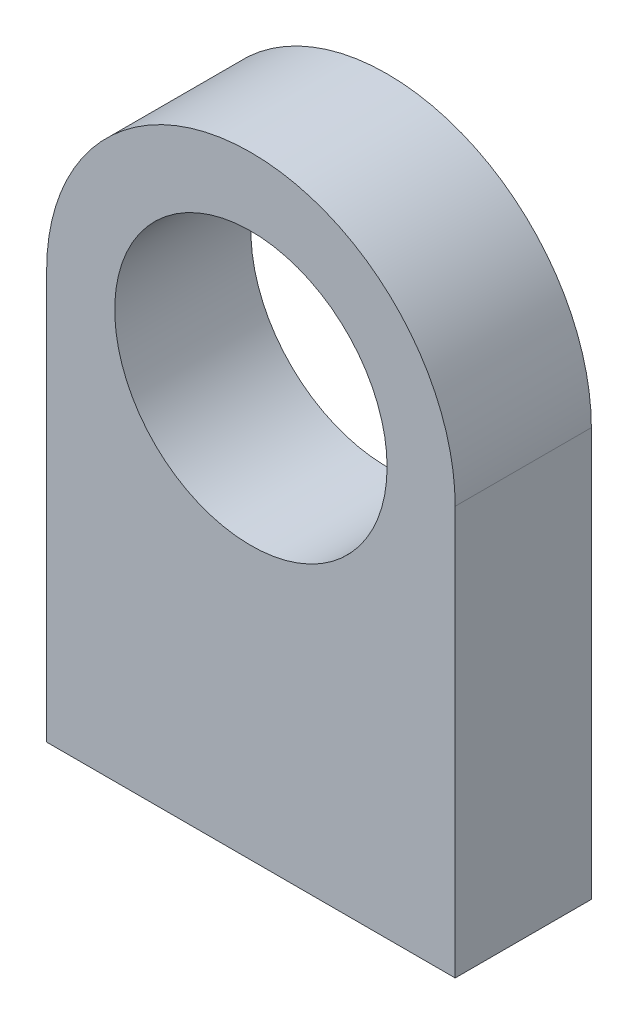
ISO-10303-21;
HEADER;
FILE_DESCRIPTION(('STEP AP214'),'2;1');
FILE_NAME('part.step','',(''),(''),'','','');
FILE_SCHEMA(('AUTOMOTIVE_DESIGN { 1 0 10303 214 1 1 1 1 }'));
ENDSEC;
DATA;
#1=APPLICATION_CONTEXT('core data for automotive mechanical design processes');
#2=APPLICATION_PROTOCOL_DEFINITION('international standard','automotive_design',2000,#1);
#3=PRODUCT_CONTEXT('',#1,'mechanical');
#4=PRODUCT('Part','Part','',(#3));
#5=PRODUCT_RELATED_PRODUCT_CATEGORY('part','',(#4));
#6=PRODUCT_DEFINITION_FORMATION('','',#4);
#7=PRODUCT_DEFINITION_CONTEXT('part definition',#1,'design');
#8=PRODUCT_DEFINITION('design','',#6,#7);
#9=PRODUCT_DEFINITION_SHAPE('','',#8);
#10=(LENGTH_UNIT() NAMED_UNIT(*) SI_UNIT(.MILLI.,.METRE.));
#11=(NAMED_UNIT(*) PLANE_ANGLE_UNIT() SI_UNIT($,.RADIAN.));
#12=(NAMED_UNIT(*) SI_UNIT($,.STERADIAN.) SOLID_ANGLE_UNIT());
#13=UNCERTAINTY_MEASURE_WITH_UNIT(LENGTH_MEASURE(1.E-05),#10,'distance_accuracy_value','');
#14=(GEOMETRIC_REPRESENTATION_CONTEXT(3) GLOBAL_UNCERTAINTY_ASSIGNED_CONTEXT((#13)) GLOBAL_UNIT_ASSIGNED_CONTEXT((#10,
#11,#12)) REPRESENTATION_CONTEXT('',''));
#15=CARTESIAN_POINT('',(0.,0.,0.));
#16=DIRECTION('',(0.,0.,1.));
#17=DIRECTION('',(1.,0.,0.));
#18=AXIS2_PLACEMENT_3D('',#15,#16,#17);
#19=CARTESIAN_POINT('',(0.,0.,10.));
#20=DIRECTION('',(0.,0.,-1.));
#21=DIRECTION('',(-1.,0.,0.));
#22=AXIS2_PLACEMENT_3D('',#19,#20,#21);
#23=CYLINDRICAL_SURFACE('',#22,15.);
#24=CARTESIAN_POINT('',(0.,0.,0.));
#25=DIRECTION('',(0.,0.,1.));
#26=DIRECTION('',(1.,0.,0.));
#27=AXIS2_PLACEMENT_3D('',#24,#25,#26);
#28=CIRCLE('',#27,15.);
#29=CARTESIAN_POINT('',(15.,0.,0.));
#30=VERTEX_POINT('',#29);
#31=CARTESIAN_POINT('',(-15.,0.,0.));
#32=VERTEX_POINT('',#31);
#33=EDGE_CURVE('E95',#30,#32,#28,.T.);
#34=ORIENTED_EDGE('',*,*,#33,.T.);
#35=DIRECTION('',(0.,0.,-1.));
#36=VECTOR('',#35,1.);
#37=CARTESIAN_POINT('',(-15.,0.,10.));
#38=LINE('',#37,#36);
#39=CARTESIAN_POINT('',(-15.,0.,10.));
#40=VERTEX_POINT('',#39);
#41=EDGE_CURVE('E11',#40,#32,#38,.T.);
#42=ORIENTED_EDGE('',*,*,#41,.F.);
#43=CARTESIAN_POINT('',(0.,0.,10.));
#44=DIRECTION('',(0.,0.,1.));
#45=DIRECTION('',(1.,0.,0.));
#46=AXIS2_PLACEMENT_3D('',#43,#44,#45);
#47=CIRCLE('',#46,15.);
#48=CARTESIAN_POINT('',(15.,0.,10.));
#49=VERTEX_POINT('',#48);
#50=EDGE_CURVE('E83',#49,#40,#47,.T.);
#51=ORIENTED_EDGE('',*,*,#50,.F.);
#52=DIRECTION('',(0.,0.,-1.));
#53=VECTOR('',#52,1.);
#54=CARTESIAN_POINT('',(15.,0.,10.));
#55=LINE('',#54,#53);
#56=EDGE_CURVE('E91',#49,#30,#55,.T.);
#57=ORIENTED_EDGE('',*,*,#56,.T.);
#58=EDGE_LOOP('',(#34,#42,#51,#57));
#59=FACE_BOUND('',#58,.T.);
#60=ADVANCED_FACE('F32',(#59),#23,.T.);
#61=CARTESIAN_POINT('',(-15.,0.,10.));
#62=DIRECTION('',(1.,0.,0.));
#63=DIRECTION('',(0.,1.,0.));
#64=AXIS2_PLACEMENT_3D('',#61,#62,#63);
#65=PLANE('',#64);
#66=DIRECTION('',(0.,-1.,0.));
#67=VECTOR('',#66,1.);
#68=CARTESIAN_POINT('',(-15.,0.,0.));
#69=LINE('',#68,#67);
#70=CARTESIAN_POINT('',(-15.,-30.,0.));
#71=VERTEX_POINT('',#70);
#72=EDGE_CURVE('E87',#32,#71,#69,.T.);
#73=ORIENTED_EDGE('',*,*,#72,.T.);
#74=DIRECTION('',(0.,0.,-1.));
#75=VECTOR('',#74,1.);
#76=CARTESIAN_POINT('',(-15.,-30.,10.));
#77=LINE('',#76,#75);
#78=CARTESIAN_POINT('',(-15.,-30.,10.));
#79=VERTEX_POINT('',#78);
#80=EDGE_CURVE('E40',#79,#71,#77,.T.);
#81=ORIENTED_EDGE('',*,*,#80,.F.);
#82=DIRECTION('',(0.,-1.,0.));
#83=VECTOR('',#82,1.);
#84=CARTESIAN_POINT('',(-15.,0.,10.));
#85=LINE('',#84,#83);
#86=EDGE_CURVE('E78',#40,#79,#85,.T.);
#87=ORIENTED_EDGE('',*,*,#86,.F.);
#88=ORIENTED_EDGE('',*,*,#41,.T.);
#89=EDGE_LOOP('',(#73,#81,#87,#88));
#90=FACE_BOUND('',#89,.T.);
#91=ADVANCED_FACE('F86',(#90),#65,.F.);
#92=CARTESIAN_POINT('',(-15.,-30.,10.));
#93=DIRECTION('',(0.,1.,0.));
#94=DIRECTION('',(0.,0.,1.));
#95=AXIS2_PLACEMENT_3D('',#92,#93,#94);
#96=PLANE('',#95);
#97=DIRECTION('',(1.,0.,0.));
#98=VECTOR('',#97,1.);
#99=CARTESIAN_POINT('',(-15.,-30.,0.));
#100=LINE('',#99,#98);
#101=CARTESIAN_POINT('',(15.,-30.,0.));
#102=VERTEX_POINT('',#101);
#103=EDGE_CURVE('E65',#71,#102,#100,.T.);
#104=ORIENTED_EDGE('',*,*,#103,.T.);
#105=DIRECTION('',(0.,0.,-1.));
#106=VECTOR('',#105,1.);
#107=CARTESIAN_POINT('',(15.,-30.,10.));
#108=LINE('',#107,#106);
#109=CARTESIAN_POINT('',(15.,-30.,10.));
#110=VERTEX_POINT('',#109);
#111=EDGE_CURVE('E88',#110,#102,#108,.T.);
#112=ORIENTED_EDGE('',*,*,#111,.F.);
#113=DIRECTION('',(1.,0.,0.));
#114=VECTOR('',#113,1.);
#115=CARTESIAN_POINT('',(-15.,-30.,10.));
#116=LINE('',#115,#114);
#117=EDGE_CURVE('E81',#79,#110,#116,.T.);
#118=ORIENTED_EDGE('',*,*,#117,.F.);
#119=ORIENTED_EDGE('',*,*,#80,.T.);
#120=EDGE_LOOP('',(#104,#112,#118,#119));
#121=FACE_BOUND('',#120,.T.);
#122=ADVANCED_FACE('F89',(#121),#96,.F.);
#123=CARTESIAN_POINT('',(15.,-30.,10.));
#124=DIRECTION('',(-1.,0.,0.));
#125=DIRECTION('',(0.,-1.,0.));
#126=AXIS2_PLACEMENT_3D('',#123,#124,#125);
#127=PLANE('',#126);
#128=DIRECTION('',(0.,1.,0.));
#129=VECTOR('',#128,1.);
#130=CARTESIAN_POINT('',(15.,-30.,0.));
#131=LINE('',#130,#129);
#132=EDGE_CURVE('E71',#102,#30,#131,.T.);
#133=ORIENTED_EDGE('',*,*,#132,.T.);
#134=ORIENTED_EDGE('',*,*,#56,.F.);
#135=DIRECTION('',(0.,1.,0.));
#136=VECTOR('',#135,1.);
#137=CARTESIAN_POINT('',(15.,-30.,10.));
#138=LINE('',#137,#136);
#139=EDGE_CURVE('E48',#110,#49,#138,.T.);
#140=ORIENTED_EDGE('',*,*,#139,.F.);
#141=ORIENTED_EDGE('',*,*,#111,.T.);
#142=EDGE_LOOP('',(#133,#134,#140,#141));
#143=FACE_BOUND('',#142,.T.);
#144=ADVANCED_FACE('F103',(#143),#127,.F.);
#145=CARTESIAN_POINT('',(0.,0.,10.));
#146=DIRECTION('',(0.,0.,1.));
#147=DIRECTION('',(1.,0.,0.));
#148=AXIS2_PLACEMENT_3D('',#145,#146,#147);
#149=PLANE('',#148);
#150=CARTESIAN_POINT('',(0.,0.,10.));
#151=DIRECTION('',(0.,0.,1.));
#152=DIRECTION('',(1.,0.,0.));
#153=AXIS2_PLACEMENT_3D('',#150,#151,#152);
#154=CIRCLE('',#153,10.);
#155=CARTESIAN_POINT('',(10.,0.,10.));
#156=VERTEX_POINT('',#155);
#157=EDGE_CURVE('E109',#156,#156,#154,.T.);
#158=ORIENTED_EDGE('',*,*,#157,.F.);
#159=EDGE_LOOP('',(#158));
#160=FACE_BOUND('',#159,.T.);
#161=ORIENTED_EDGE('',*,*,#50,.T.);
#162=ORIENTED_EDGE('',*,*,#86,.T.);
#163=ORIENTED_EDGE('',*,*,#117,.T.);
#164=ORIENTED_EDGE('',*,*,#139,.T.);
#165=EDGE_LOOP('',(#161,#162,#163,#164));
#166=FACE_BOUND('',#165,.T.);
#167=ADVANCED_FACE('F79',(#160,#166),#149,.T.);
#168=CARTESIAN_POINT('',(0.,0.,0.));
#169=DIRECTION('',(0.,0.,1.));
#170=DIRECTION('',(1.,0.,0.));
#171=AXIS2_PLACEMENT_3D('',#168,#169,#170);
#172=PLANE('',#171);
#173=CARTESIAN_POINT('',(0.,0.,0.));
#174=DIRECTION('',(0.,0.,1.));
#175=DIRECTION('',(1.,0.,0.));
#176=AXIS2_PLACEMENT_3D('',#173,#174,#175);
#177=CIRCLE('',#176,10.);
#178=CARTESIAN_POINT('',(10.,0.,0.));
#179=VERTEX_POINT('',#178);
#180=EDGE_CURVE('E98',#179,#179,#177,.T.);
#181=ORIENTED_EDGE('',*,*,#180,.T.);
#182=EDGE_LOOP('',(#181));
#183=FACE_BOUND('',#182,.T.);
#184=ORIENTED_EDGE('',*,*,#33,.F.);
#185=ORIENTED_EDGE('',*,*,#132,.F.);
#186=ORIENTED_EDGE('',*,*,#103,.F.);
#187=ORIENTED_EDGE('',*,*,#72,.F.);
#188=EDGE_LOOP('',(#184,#185,#186,#187));
#189=FACE_BOUND('',#188,.T.);
#190=ADVANCED_FACE('F106',(#183,#189),#172,.F.);
#191=CARTESIAN_POINT('',(0.,0.,0.));
#192=DIRECTION('',(0.,0.,1.));
#193=DIRECTION('',(1.,0.,0.));
#194=AXIS2_PLACEMENT_3D('',#191,#192,#193);
#195=CYLINDRICAL_SURFACE('',#194,10.);
#196=ORIENTED_EDGE('',*,*,#180,.F.);
#197=EDGE_LOOP('',(#196));
#198=FACE_BOUND('',#197,.T.);
#199=ORIENTED_EDGE('',*,*,#157,.T.);
#200=EDGE_LOOP('',(#199));
#201=FACE_BOUND('',#200,.T.);
#202=ADVANCED_FACE('F116',(#198,#201),#195,.F.);
#203=CLOSED_SHELL('',(#60,#91,#122,#144,#167,#190,#202));
#204=MANIFOLD_SOLID_BREP('B2',#203);
#205=ADVANCED_BREP_SHAPE_REPRESENTATION('',(#18,#204),#14);
#206=SHAPE_DEFINITION_REPRESENTATION(#9,#205);
ENDSEC;
END-ISO-10303-21;
